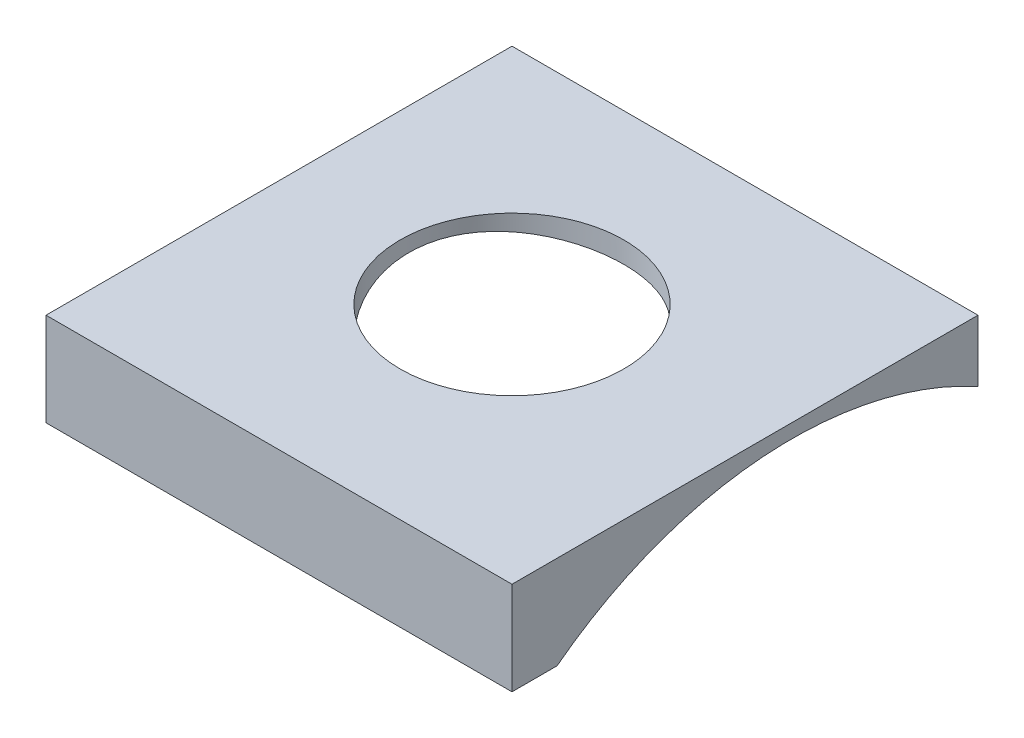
from build123d import *

# Parameters (mm, degrees)
SKETCH1_W          = 25
SKETCH1_H          = 25
SKETCH1_R          = 6
EXTRUDE1_DEPTH     = 5
SKETCH2_R          = 20.75
CUT_EXTRUDE1_DEPTH = 36.707142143


with BuildPart() as part:
    # Sketch1 → Extrude1 (new body)
    with BuildSketch(Plane(origin=(0, 0, 0), x_dir=(1, 0, 0), z_dir=(0, 1, 0))):
        with Locations((12.5, -12.5)):
            Rectangle(SKETCH1_W, SKETCH1_H)
        with Locations(Location((12, -12, 0), (0, 0, 270))):
            Circle(SKETCH1_R, mode=Mode.SUBTRACT)
    extrude(amount=-EXTRUDE1_DEPTH)

    # Sketch2 → Cut-Extrude1 (cut, through all)
    with BuildSketch(Plane(origin=(0, 0, 0), x_dir=(0, 0, -1), z_dir=(1, 0, 0))):
        with Locations((-10, -21.5)):
            Circle(SKETCH2_R)
    extrude(amount=CUT_EXTRUDE1_DEPTH, mode=Mode.SUBTRACT)


solid = part.part
